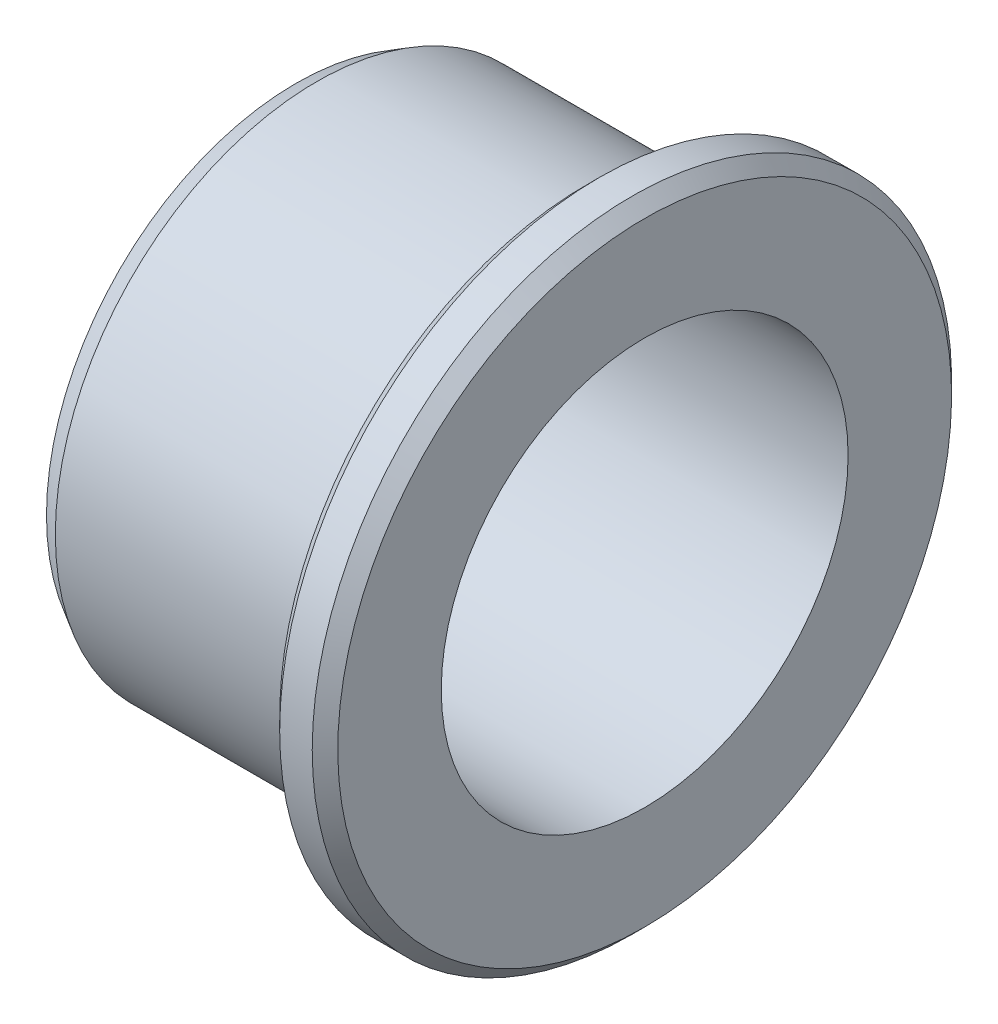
ISO-10303-21;
HEADER;
FILE_DESCRIPTION(('STEP AP214'),'2;1');
FILE_NAME('part.step','',(''),(''),'','','');
FILE_SCHEMA(('AUTOMOTIVE_DESIGN { 1 0 10303 214 1 1 1 1 }'));
ENDSEC;
DATA;
#1=APPLICATION_CONTEXT('core data for automotive mechanical design processes');
#2=APPLICATION_PROTOCOL_DEFINITION('international standard','automotive_design',2000,#1);
#3=PRODUCT_CONTEXT('',#1,'mechanical');
#4=PRODUCT('Part','Part','',(#3));
#5=PRODUCT_RELATED_PRODUCT_CATEGORY('part','',(#4));
#6=PRODUCT_DEFINITION_FORMATION('','',#4);
#7=PRODUCT_DEFINITION_CONTEXT('part definition',#1,'design');
#8=PRODUCT_DEFINITION('design','',#6,#7);
#9=PRODUCT_DEFINITION_SHAPE('','',#8);
#10=(LENGTH_UNIT() NAMED_UNIT(*) SI_UNIT(.MILLI.,.METRE.));
#11=(NAMED_UNIT(*) PLANE_ANGLE_UNIT() SI_UNIT($,.RADIAN.));
#12=(NAMED_UNIT(*) SI_UNIT($,.STERADIAN.) SOLID_ANGLE_UNIT());
#13=UNCERTAINTY_MEASURE_WITH_UNIT(LENGTH_MEASURE(1.E-05),#10,'distance_accuracy_value','');
#14=(GEOMETRIC_REPRESENTATION_CONTEXT(3) GLOBAL_UNCERTAINTY_ASSIGNED_CONTEXT((#13)) GLOBAL_UNIT_ASSIGNED_CONTEXT((#10,
#11,#12)) REPRESENTATION_CONTEXT('',''));
#15=CARTESIAN_POINT('',(0.,0.,0.));
#16=DIRECTION('',(0.,0.,1.));
#17=DIRECTION('',(1.,0.,0.));
#18=AXIS2_PLACEMENT_3D('',#15,#16,#17);
#19=CARTESIAN_POINT('',(10.44,0.,0.));
#20=DIRECTION('',(1.,0.,0.));
#21=DIRECTION('',(0.,0.,-1.));
#22=AXIS2_PLACEMENT_3D('',#19,#20,#21);
#23=CONICAL_SURFACE('',#22,11.,0.785398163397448);
#24=CARTESIAN_POINT('',(10.,0.,0.));
#25=DIRECTION('',(1.,0.,0.));
#26=DIRECTION('',(0.,0.,-1.));
#27=AXIS2_PLACEMENT_3D('',#24,#25,#26);
#28=CIRCLE('',#27,10.56);
#29=CARTESIAN_POINT('',(10.,0.,-10.56));
#30=VERTEX_POINT('',#29);
#31=EDGE_CURVE('E18',#30,#30,#28,.F.);
#32=ORIENTED_EDGE('',*,*,#31,.F.);
#33=EDGE_LOOP('',(#32));
#34=FACE_BOUND('',#33,.T.);
#35=CARTESIAN_POINT('',(10.44,0.,0.));
#36=DIRECTION('',(-1.,0.,0.));
#37=DIRECTION('',(0.,0.,1.));
#38=AXIS2_PLACEMENT_3D('',#35,#36,#37);
#39=CIRCLE('',#38,11.);
#40=CARTESIAN_POINT('',(10.44,0.,11.));
#41=VERTEX_POINT('',#40);
#42=EDGE_CURVE('E30',#41,#41,#39,.F.);
#43=ORIENTED_EDGE('',*,*,#42,.F.);
#44=EDGE_LOOP('',(#43));
#45=FACE_BOUND('',#44,.T.);
#46=ADVANCED_FACE('F15',(#34,#45),#23,.T.);
#47=CARTESIAN_POINT('',(10.,0.,9.78));
#48=DIRECTION('',(-1.,0.,0.));
#49=DIRECTION('',(0.,0.,1.));
#50=AXIS2_PLACEMENT_3D('',#47,#48,#49);
#51=PLANE('',#50);
#52=ORIENTED_EDGE('',*,*,#31,.T.);
#53=EDGE_LOOP('',(#52));
#54=FACE_BOUND('',#53,.T.);
#55=CARTESIAN_POINT('',(10.,0.,0.));
#56=DIRECTION('',(-1.,0.,0.));
#57=DIRECTION('',(0.,0.,1.));
#58=AXIS2_PLACEMENT_3D('',#55,#56,#57);
#59=CIRCLE('',#58,9.);
#60=CARTESIAN_POINT('',(10.,0.,9.));
#61=VERTEX_POINT('',#60);
#62=EDGE_CURVE('E38',#61,#61,#59,.T.);
#63=ORIENTED_EDGE('',*,*,#62,.F.);
#64=EDGE_LOOP('',(#63));
#65=FACE_BOUND('',#64,.T.);
#66=ADVANCED_FACE('F50',(#54,#65),#51,.T.);
#67=CARTESIAN_POINT('',(11.,0.,0.));
#68=DIRECTION('',(-1.,0.,0.));
#69=DIRECTION('',(0.,0.,1.));
#70=AXIS2_PLACEMENT_3D('',#67,#68,#69);
#71=CYLINDRICAL_SURFACE('',#70,11.);
#72=ORIENTED_EDGE('',*,*,#42,.T.);
#73=EDGE_LOOP('',(#72));
#74=FACE_BOUND('',#73,.T.);
#75=CARTESIAN_POINT('',(11.56,0.,0.));
#76=DIRECTION('',(-1.,0.,0.));
#77=DIRECTION('',(0.,0.,1.));
#78=AXIS2_PLACEMENT_3D('',#75,#76,#77);
#79=CIRCLE('',#78,11.);
#80=CARTESIAN_POINT('',(11.56,0.,11.));
#81=VERTEX_POINT('',#80);
#82=EDGE_CURVE('E40',#81,#81,#79,.F.);
#83=ORIENTED_EDGE('',*,*,#82,.F.);
#84=EDGE_LOOP('',(#83));
#85=FACE_BOUND('',#84,.T.);
#86=ADVANCED_FACE('F59',(#74,#85),#71,.T.);
#87=CARTESIAN_POINT('',(5.36,0.,0.));
#88=DIRECTION('',(-1.,0.,0.));
#89=DIRECTION('',(0.,0.,1.));
#90=AXIS2_PLACEMENT_3D('',#87,#88,#89);
#91=CYLINDRICAL_SURFACE('',#90,9.);
#92=CARTESIAN_POINT('',(0.720000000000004,0.,0.));
#93=DIRECTION('',(1.,0.,0.));
#94=DIRECTION('',(0.,0.,1.));
#95=AXIS2_PLACEMENT_3D('',#92,#93,#94);
#96=CIRCLE('',#95,9.);
#97=CARTESIAN_POINT('',(0.720000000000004,0.,9.));
#98=VERTEX_POINT('',#97);
#99=EDGE_CURVE('E37',#98,#98,#96,.F.);
#100=ORIENTED_EDGE('',*,*,#99,.F.);
#101=EDGE_LOOP('',(#100));
#102=FACE_BOUND('',#101,.T.);
#103=ORIENTED_EDGE('',*,*,#62,.T.);
#104=EDGE_LOOP('',(#103));
#105=FACE_BOUND('',#104,.T.);
#106=ADVANCED_FACE('F83',(#102,#105),#91,.T.);
#107=CARTESIAN_POINT('',(11.56,0.,0.));
#108=DIRECTION('',(-1.,0.,0.));
#109=DIRECTION('',(0.,-1.,0.));
#110=AXIS2_PLACEMENT_3D('',#107,#108,#109);
#111=CONICAL_SURFACE('',#110,11.,0.785398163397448);
#112=ORIENTED_EDGE('',*,*,#82,.T.);
#113=EDGE_LOOP('',(#112));
#114=FACE_BOUND('',#113,.T.);
#115=CARTESIAN_POINT('',(12.,0.,0.));
#116=DIRECTION('',(-1.,0.,0.));
#117=DIRECTION('',(0.,-1.,0.));
#118=AXIS2_PLACEMENT_3D('',#115,#116,#117);
#119=CIRCLE('',#118,10.56);
#120=CARTESIAN_POINT('',(12.,-10.56,0.));
#121=VERTEX_POINT('',#120);
#122=EDGE_CURVE('E35',#121,#121,#119,.F.);
#123=ORIENTED_EDGE('',*,*,#122,.F.);
#124=EDGE_LOOP('',(#123));
#125=FACE_BOUND('',#124,.T.);
#126=ADVANCED_FACE('F79',(#114,#125),#111,.T.);
#127=CARTESIAN_POINT('',(0.720000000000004,0.,0.));
#128=DIRECTION('',(1.,0.,0.));
#129=DIRECTION('',(0.,0.,-1.));
#130=AXIS2_PLACEMENT_3D('',#127,#128,#129);
#131=CONICAL_SURFACE('',#130,9.,0.5235987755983);
#132=CARTESIAN_POINT('',(0.,0.,0.));
#133=DIRECTION('',(1.,0.,0.));
#134=DIRECTION('',(0.,0.,-1.));
#135=AXIS2_PLACEMENT_3D('',#132,#133,#134);
#136=CIRCLE('',#135,8.58430780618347);
#137=CARTESIAN_POINT('',(0.,0.,-8.58430780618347));
#138=VERTEX_POINT('',#137);
#139=EDGE_CURVE('E27',#138,#138,#136,.F.);
#140=ORIENTED_EDGE('',*,*,#139,.F.);
#141=EDGE_LOOP('',(#140));
#142=FACE_BOUND('',#141,.T.);
#143=ORIENTED_EDGE('',*,*,#99,.T.);
#144=EDGE_LOOP('',(#143));
#145=FACE_BOUND('',#144,.T.);
#146=ADVANCED_FACE('F75',(#142,#145),#131,.T.);
#147=CARTESIAN_POINT('',(12.,0.,5.28));
#148=DIRECTION('',(1.,0.,0.));
#149=DIRECTION('',(0.,0.,-1.));
#150=AXIS2_PLACEMENT_3D('',#147,#148,#149);
#151=PLANE('',#150);
#152=ORIENTED_EDGE('',*,*,#122,.T.);
#153=EDGE_LOOP('',(#152));
#154=FACE_BOUND('',#153,.T.);
#155=CARTESIAN_POINT('',(12.,0.,0.));
#156=DIRECTION('',(1.,0.,0.));
#157=DIRECTION('',(0.,0.,-1.));
#158=AXIS2_PLACEMENT_3D('',#155,#156,#157);
#159=CIRCLE('',#158,7.);
#160=CARTESIAN_POINT('',(12.,0.,-7.));
#161=VERTEX_POINT('',#160);
#162=EDGE_CURVE('E22',#161,#161,#159,.F.);
#163=ORIENTED_EDGE('',*,*,#162,.T.);
#164=EDGE_LOOP('',(#163));
#165=FACE_BOUND('',#164,.T.);
#166=ADVANCED_FACE('F68',(#154,#165),#151,.T.);
#167=CARTESIAN_POINT('',(0.,0.,4.29215390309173));
#168=DIRECTION('',(-1.,0.,0.));
#169=DIRECTION('',(0.,0.,1.));
#170=AXIS2_PLACEMENT_3D('',#167,#168,#169);
#171=PLANE('',#170);
#172=ORIENTED_EDGE('',*,*,#139,.T.);
#173=EDGE_LOOP('',(#172));
#174=FACE_BOUND('',#173,.T.);
#175=CARTESIAN_POINT('',(0.,0.,0.));
#176=DIRECTION('',(1.,0.,0.));
#177=DIRECTION('',(0.,0.,-1.));
#178=AXIS2_PLACEMENT_3D('',#175,#176,#177);
#179=CIRCLE('',#178,7.);
#180=CARTESIAN_POINT('',(0.,0.,-7.));
#181=VERTEX_POINT('',#180);
#182=EDGE_CURVE('E10',#181,#181,#179,.T.);
#183=ORIENTED_EDGE('',*,*,#182,.T.);
#184=EDGE_LOOP('',(#183));
#185=FACE_BOUND('',#184,.T.);
#186=ADVANCED_FACE('F62',(#174,#185),#171,.T.);
#187=CARTESIAN_POINT('',(6.,0.,0.));
#188=DIRECTION('',(1.,0.,0.));
#189=DIRECTION('',(0.,0.,-1.));
#190=AXIS2_PLACEMENT_3D('',#187,#188,#189);
#191=CYLINDRICAL_SURFACE('',#190,7.);
#192=ORIENTED_EDGE('',*,*,#182,.F.);
#193=EDGE_LOOP('',(#192));
#194=FACE_BOUND('',#193,.T.);
#195=ORIENTED_EDGE('',*,*,#162,.F.);
#196=EDGE_LOOP('',(#195));
#197=FACE_BOUND('',#196,.T.);
#198=ADVANCED_FACE('F60',(#194,#197),#191,.F.);
#199=CLOSED_SHELL('',(#46,#66,#86,#106,#126,#146,#166,#186,#198));
#200=MANIFOLD_SOLID_BREP('B1',#199);
#201=ADVANCED_BREP_SHAPE_REPRESENTATION('',(#18,#200),#14);
#202=SHAPE_DEFINITION_REPRESENTATION(#9,#201);
ENDSEC;
END-ISO-10303-21;
